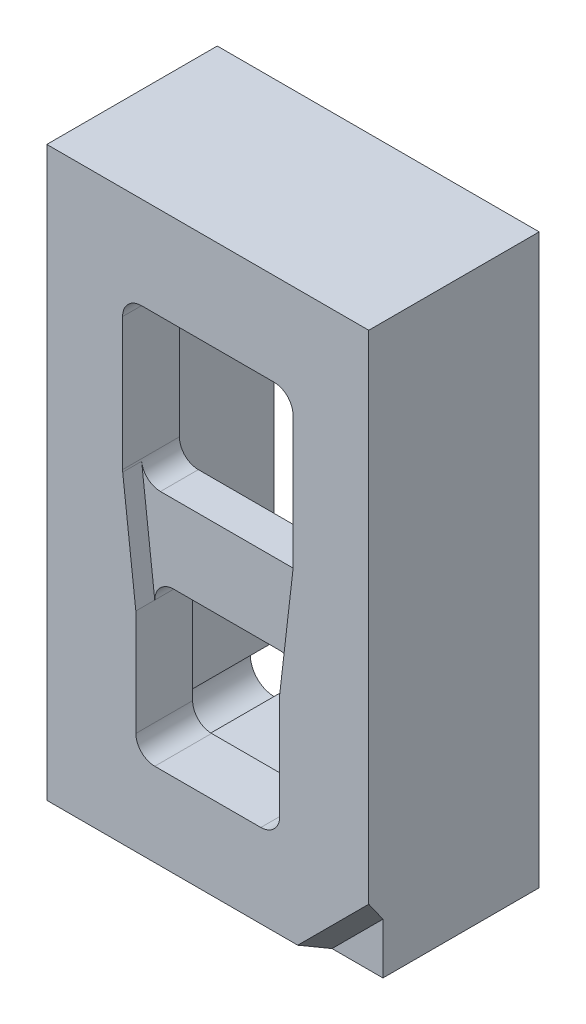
ISO-10303-21;
HEADER;
FILE_DESCRIPTION(('STEP AP214'),'2;1');
FILE_NAME('part.step','',(''),(''),'','','');
FILE_SCHEMA(('AUTOMOTIVE_DESIGN { 1 0 10303 214 1 1 1 1 }'));
ENDSEC;
DATA;
#1=APPLICATION_CONTEXT('core data for automotive mechanical design processes');
#2=APPLICATION_PROTOCOL_DEFINITION('international standard','automotive_design',2000,#1);
#3=PRODUCT_CONTEXT('',#1,'mechanical');
#4=PRODUCT('Part','Part','',(#3));
#5=PRODUCT_RELATED_PRODUCT_CATEGORY('part','',(#4));
#6=PRODUCT_DEFINITION_FORMATION('','',#4);
#7=PRODUCT_DEFINITION_CONTEXT('part definition',#1,'design');
#8=PRODUCT_DEFINITION('design','',#6,#7);
#9=PRODUCT_DEFINITION_SHAPE('','',#8);
#10=(LENGTH_UNIT() NAMED_UNIT(*) SI_UNIT(.MILLI.,.METRE.));
#11=(NAMED_UNIT(*) PLANE_ANGLE_UNIT() SI_UNIT($,.RADIAN.));
#12=(NAMED_UNIT(*) SI_UNIT($,.STERADIAN.) SOLID_ANGLE_UNIT());
#13=UNCERTAINTY_MEASURE_WITH_UNIT(LENGTH_MEASURE(1.E-05),#10,'distance_accuracy_value','');
#14=(GEOMETRIC_REPRESENTATION_CONTEXT(3) GLOBAL_UNCERTAINTY_ASSIGNED_CONTEXT((#13)) GLOBAL_UNIT_ASSIGNED_CONTEXT((#10,
#11,#12)) REPRESENTATION_CONTEXT('',''));
#15=CARTESIAN_POINT('',(0.,0.,0.));
#16=DIRECTION('',(0.,0.,1.));
#17=DIRECTION('',(1.,0.,0.));
#18=AXIS2_PLACEMENT_3D('',#15,#16,#17);
#19=CARTESIAN_POINT('',(-0.9,0.225,0.6));
#20=DIRECTION('',(0.,1.,0.));
#21=DIRECTION('',(0.,0.,1.));
#22=AXIS2_PLACEMENT_3D('',#19,#20,#21);
#23=PLANE('',#22);
#24=DIRECTION('',(0.,0.,-1.));
#25=VECTOR('',#24,1.);
#26=CARTESIAN_POINT('',(-0.7,0.225,0.6));
#27=LINE('',#26,#25);
#28=CARTESIAN_POINT('',(-0.7,0.225,0.));
#29=VERTEX_POINT('',#28);
#30=CARTESIAN_POINT('',(-0.7,0.225,0.4));
#31=VERTEX_POINT('',#30);
#32=EDGE_CURVE('E401',#29,#31,#27,.F.);
#33=ORIENTED_EDGE('',*,*,#32,.T.);
#34=DIRECTION('',(1.,0.,0.));
#35=VECTOR('',#34,1.);
#36=CARTESIAN_POINT('',(-0.9,0.225,0.4));
#37=LINE('',#36,#35);
#38=CARTESIAN_POINT('',(0.7,0.225,0.4));
#39=VERTEX_POINT('',#38);
#40=EDGE_CURVE('E601',#31,#39,#37,.T.);
#41=ORIENTED_EDGE('',*,*,#40,.T.);
#42=DIRECTION('',(0.,0.,-1.));
#43=VECTOR('',#42,1.);
#44=CARTESIAN_POINT('',(0.7,0.225,0.));
#45=LINE('',#44,#43);
#46=CARTESIAN_POINT('',(0.7,0.225,0.));
#47=VERTEX_POINT('',#46);
#48=EDGE_CURVE('E419',#39,#47,#45,.T.);
#49=ORIENTED_EDGE('',*,*,#48,.T.);
#50=DIRECTION('',(1.,0.,0.));
#51=VECTOR('',#50,1.);
#52=CARTESIAN_POINT('',(-0.9,0.225,0.));
#53=LINE('',#52,#51);
#54=EDGE_CURVE('E393',#29,#47,#53,.T.);
#55=ORIENTED_EDGE('',*,*,#54,.F.);
#56=EDGE_LOOP('',(#33,#41,#49,#55));
#57=FACE_BOUND('',#56,.T.);
#58=ADVANCED_FACE('F40',(#57),#23,.T.);
#59=CARTESIAN_POINT('',(-0.76,-0.598,0.6));
#60=DIRECTION('',(0.,-1.,0.));
#61=DIRECTION('',(0.,0.,-1.));
#62=AXIS2_PLACEMENT_3D('',#59,#60,#61);
#63=PLANE('',#62);
#64=DIRECTION('',(0.,0.,-1.));
#65=VECTOR('',#64,1.);
#66=CARTESIAN_POINT('',(0.56,-0.598,0.6));
#67=LINE('',#66,#65);
#68=CARTESIAN_POINT('',(0.56,-0.598,0.));
#69=VERTEX_POINT('',#68);
#70=CARTESIAN_POINT('',(0.56,-0.598,0.4));
#71=VERTEX_POINT('',#70);
#72=EDGE_CURVE('E461',#69,#71,#67,.F.);
#73=ORIENTED_EDGE('',*,*,#72,.T.);
#74=DIRECTION('',(-1.,0.,0.));
#75=VECTOR('',#74,1.);
#76=CARTESIAN_POINT('',(-0.76,-0.598,0.4));
#77=LINE('',#76,#75);
#78=CARTESIAN_POINT('',(-0.56,-0.598,0.4));
#79=VERTEX_POINT('',#78);
#80=EDGE_CURVE('E585',#71,#79,#77,.T.);
#81=ORIENTED_EDGE('',*,*,#80,.T.);
#82=DIRECTION('',(0.,0.,-1.));
#83=VECTOR('',#82,1.);
#84=CARTESIAN_POINT('',(-0.56,-0.598,0.));
#85=LINE('',#84,#83);
#86=CARTESIAN_POINT('',(-0.56,-0.598,0.));
#87=VERTEX_POINT('',#86);
#88=EDGE_CURVE('E458',#79,#87,#85,.T.);
#89=ORIENTED_EDGE('',*,*,#88,.T.);
#90=DIRECTION('',(-1.,0.,0.));
#91=VECTOR('',#90,1.);
#92=CARTESIAN_POINT('',(-0.76,-0.598,0.));
#93=LINE('',#92,#91);
#94=EDGE_CURVE('E377',#69,#87,#93,.T.);
#95=ORIENTED_EDGE('',*,*,#94,.F.);
#96=EDGE_LOOP('',(#73,#81,#89,#95));
#97=FACE_BOUND('',#96,.T.);
#98=ADVANCED_FACE('F739',(#97),#63,.T.);
#99=CARTESIAN_POINT('',(0.7,0.425,0.6));
#100=DIRECTION('',(0.,0.,1.));
#101=DIRECTION('',(1.,0.,0.));
#102=AXIS2_PLACEMENT_3D('',#99,#100,#101);
#103=CYLINDRICAL_SURFACE('',#102,0.2);
#104=DIRECTION('',(0.,0.,1.));
#105=VECTOR('',#104,1.);
#106=CARTESIAN_POINT('',(0.898677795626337,0.402040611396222,0.4));
#107=LINE('',#106,#105);
#108=CARTESIAN_POINT('',(0.898677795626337,0.402040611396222,0.4));
#109=VERTEX_POINT('',#108);
#110=CARTESIAN_POINT('',(0.898677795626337,0.402040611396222,0.6));
#111=VERTEX_POINT('',#110);
#112=EDGE_CURVE('E581',#109,#111,#107,.T.);
#113=ORIENTED_EDGE('',*,*,#112,.T.);
#114=CARTESIAN_POINT('',(0.7,0.425,0.6));
#115=DIRECTION('',(0.,0.,1.));
#116=DIRECTION('',(1.,0.,0.));
#117=AXIS2_PLACEMENT_3D('',#114,#115,#116);
#118=CIRCLE('',#117,0.2);
#119=CARTESIAN_POINT('',(0.9,0.425,0.6));
#120=VERTEX_POINT('',#119);
#121=EDGE_CURVE('E475',#120,#111,#118,.F.);
#122=ORIENTED_EDGE('',*,*,#121,.F.);
#123=DIRECTION('',(0.,0.,-1.));
#124=VECTOR('',#123,1.);
#125=CARTESIAN_POINT('',(0.9,0.425,0.6));
#126=LINE('',#125,#124);
#127=CARTESIAN_POINT('',(0.9,0.425,0.));
#128=VERTEX_POINT('',#127);
#129=EDGE_CURVE('E426',#128,#120,#126,.F.);
#130=ORIENTED_EDGE('',*,*,#129,.F.);
#131=CARTESIAN_POINT('',(0.7,0.425,0.));
#132=DIRECTION('',(0.,0.,1.));
#133=DIRECTION('',(1.,0.,0.));
#134=AXIS2_PLACEMENT_3D('',#131,#132,#133);
#135=CIRCLE('',#134,0.2);
#136=EDGE_CURVE('E472',#47,#128,#135,.T.);
#137=ORIENTED_EDGE('',*,*,#136,.F.);
#138=ORIENTED_EDGE('',*,*,#48,.F.);
#139=CARTESIAN_POINT('',(0.7,0.425,0.4));
#140=DIRECTION('',(0.,0.,1.));
#141=DIRECTION('',(1.,0.,0.));
#142=AXIS2_PLACEMENT_3D('',#139,#140,#141);
#143=CIRCLE('',#142,0.2);
#144=EDGE_CURVE('E605',#109,#39,#143,.F.);
#145=ORIENTED_EDGE('',*,*,#144,.F.);
#146=EDGE_LOOP('',(#113,#122,#130,#137,#138,#145));
#147=FACE_BOUND('',#146,.T.);
#148=ADVANCED_FACE('F718',(#147),#103,.F.);
#149=CARTESIAN_POINT('',(0.56,-0.798,0.6));
#150=DIRECTION('',(0.,0.,1.));
#151=DIRECTION('',(1.,0.,0.));
#152=AXIS2_PLACEMENT_3D('',#149,#150,#151);
#153=CYLINDRICAL_SURFACE('',#152,0.2);
#154=CARTESIAN_POINT('',(0.56,-0.798,0.4));
#155=DIRECTION('',(0.,0.,1.));
#156=DIRECTION('',(1.,0.,0.));
#157=AXIS2_PLACEMENT_3D('',#154,#155,#156);
#158=CIRCLE('',#157,0.2);
#159=CARTESIAN_POINT('',(0.76,-0.798,0.4));
#160=VERTEX_POINT('',#159);
#161=EDGE_CURVE('E595',#71,#160,#158,.F.);
#162=ORIENTED_EDGE('',*,*,#161,.F.);
#163=ORIENTED_EDGE('',*,*,#72,.F.);
#164=CARTESIAN_POINT('',(0.56,-0.798,0.));
#165=DIRECTION('',(0.,0.,1.));
#166=DIRECTION('',(1.,0.,0.));
#167=AXIS2_PLACEMENT_3D('',#164,#165,#166);
#168=CIRCLE('',#167,0.2);
#169=CARTESIAN_POINT('',(0.76,-0.798,0.));
#170=VERTEX_POINT('',#169);
#171=EDGE_CURVE('E497',#170,#69,#168,.T.);
#172=ORIENTED_EDGE('',*,*,#171,.F.);
#173=DIRECTION('',(0.,0.,-1.));
#174=VECTOR('',#173,1.);
#175=CARTESIAN_POINT('',(0.76,-0.798,0.));
#176=LINE('',#175,#174);
#177=EDGE_CURVE('E436',#160,#170,#176,.T.);
#178=ORIENTED_EDGE('',*,*,#177,.F.);
#179=EDGE_LOOP('',(#162,#163,#172,#178));
#180=FACE_BOUND('',#179,.T.);
#181=ADVANCED_FACE('F648',(#180),#153,.F.);
#182=CARTESIAN_POINT('',(-0.56,-0.798,0.6));
#183=DIRECTION('',(0.,0.,1.));
#184=DIRECTION('',(1.,0.,0.));
#185=AXIS2_PLACEMENT_3D('',#182,#183,#184);
#186=CYLINDRICAL_SURFACE('',#185,0.2);
#187=CARTESIAN_POINT('',(-0.56,-0.798,0.4));
#188=DIRECTION('',(0.,0.,1.));
#189=DIRECTION('',(1.,0.,0.));
#190=AXIS2_PLACEMENT_3D('',#187,#188,#189);
#191=CIRCLE('',#190,0.2);
#192=CARTESIAN_POINT('',(-0.76,-0.798,0.4));
#193=VERTEX_POINT('',#192);
#194=EDGE_CURVE('E515',#193,#79,#191,.F.);
#195=ORIENTED_EDGE('',*,*,#194,.F.);
#196=DIRECTION('',(0.,0.,-1.));
#197=VECTOR('',#196,1.);
#198=CARTESIAN_POINT('',(-0.76,-0.798,0.6));
#199=LINE('',#198,#197);
#200=CARTESIAN_POINT('',(-0.76,-0.798,0.));
#201=VERTEX_POINT('',#200);
#202=EDGE_CURVE('E450',#201,#193,#199,.F.);
#203=ORIENTED_EDGE('',*,*,#202,.F.);
#204=CARTESIAN_POINT('',(-0.56,-0.798,0.));
#205=DIRECTION('',(0.,0.,1.));
#206=DIRECTION('',(1.,0.,0.));
#207=AXIS2_PLACEMENT_3D('',#204,#205,#206);
#208=CIRCLE('',#207,0.2);
#209=EDGE_CURVE('E506',#87,#201,#208,.T.);
#210=ORIENTED_EDGE('',*,*,#209,.F.);
#211=ORIENTED_EDGE('',*,*,#88,.F.);
#212=EDGE_LOOP('',(#195,#203,#210,#211));
#213=FACE_BOUND('',#212,.T.);
#214=ADVANCED_FACE('F678',(#213),#186,.F.);
#215=CARTESIAN_POINT('',(0.,0.,0.));
#216=DIRECTION('',(0.,0.,1.));
#217=DIRECTION('',(1.,0.,0.));
#218=AXIS2_PLACEMENT_3D('',#215,#216,#217);
#219=PLANE('',#218);
#220=DIRECTION('',(1.,0.,0.));
#221=VECTOR('',#220,1.);
#222=CARTESIAN_POINT('',(-0.76,-2.118,0.));
#223=LINE('',#222,#221);
#224=CARTESIAN_POINT('',(-0.56,-2.118,0.));
#225=VERTEX_POINT('',#224);
#226=CARTESIAN_POINT('',(0.56,-2.118,0.));
#227=VERTEX_POINT('',#226);
#228=EDGE_CURVE('E365',#225,#227,#223,.T.);
#229=ORIENTED_EDGE('',*,*,#228,.T.);
#230=CARTESIAN_POINT('',(0.56,-1.918,0.));
#231=DIRECTION('',(0.,0.,1.));
#232=DIRECTION('',(1.,0.,0.));
#233=AXIS2_PLACEMENT_3D('',#230,#231,#232);
#234=CIRCLE('',#233,0.2);
#235=CARTESIAN_POINT('',(0.76,-1.918,0.));
#236=VERTEX_POINT('',#235);
#237=EDGE_CURVE('E479',#227,#236,#234,.T.);
#238=ORIENTED_EDGE('',*,*,#237,.T.);
#239=DIRECTION('',(0.,1.,0.));
#240=VECTOR('',#239,1.);
#241=CARTESIAN_POINT('',(0.76,-0.598,0.));
#242=LINE('',#241,#240);
#243=EDGE_CURVE('E359',#236,#170,#242,.T.);
#244=ORIENTED_EDGE('',*,*,#243,.T.);
#245=ORIENTED_EDGE('',*,*,#171,.T.);
#246=ORIENTED_EDGE('',*,*,#94,.T.);
#247=ORIENTED_EDGE('',*,*,#209,.T.);
#248=DIRECTION('',(0.,-1.,0.));
#249=VECTOR('',#248,1.);
#250=CARTESIAN_POINT('',(-0.76,-0.598,0.));
#251=LINE('',#250,#249);
#252=CARTESIAN_POINT('',(-0.76,-1.918,0.));
#253=VERTEX_POINT('',#252);
#254=EDGE_CURVE('E381',#201,#253,#251,.T.);
#255=ORIENTED_EDGE('',*,*,#254,.T.);
#256=CARTESIAN_POINT('',(-0.56,-1.918,0.));
#257=DIRECTION('',(0.,0.,1.));
#258=DIRECTION('',(1.,0.,0.));
#259=AXIS2_PLACEMENT_3D('',#256,#257,#258);
#260=CIRCLE('',#259,0.2);
#261=EDGE_CURVE('E491',#253,#225,#260,.T.);
#262=ORIENTED_EDGE('',*,*,#261,.T.);
#263=EDGE_LOOP('',(#229,#238,#244,#245,#246,#247,#255,#262));
#264=FACE_BOUND('',#263,.T.);
#265=ORIENTED_EDGE('',*,*,#54,.T.);
#266=ORIENTED_EDGE('',*,*,#136,.T.);
#267=DIRECTION('',(0.,1.,0.));
#268=VECTOR('',#267,1.);
#269=CARTESIAN_POINT('',(0.9,0.225,0.));
#270=LINE('',#269,#268);
#271=CARTESIAN_POINT('',(0.9,1.825,0.));
#272=VERTEX_POINT('',#271);
#273=EDGE_CURVE('E373',#128,#272,#270,.T.);
#274=ORIENTED_EDGE('',*,*,#273,.T.);
#275=CARTESIAN_POINT('',(0.7,1.825,0.));
#276=DIRECTION('',(0.,0.,1.));
#277=DIRECTION('',(1.,0.,0.));
#278=AXIS2_PLACEMENT_3D('',#275,#276,#277);
#279=CIRCLE('',#278,0.2);
#280=CARTESIAN_POINT('',(0.7,2.025,0.));
#281=VERTEX_POINT('',#280);
#282=EDGE_CURVE('E500',#272,#281,#279,.T.);
#283=ORIENTED_EDGE('',*,*,#282,.T.);
#284=DIRECTION('',(-1.,0.,0.));
#285=VECTOR('',#284,1.);
#286=CARTESIAN_POINT('',(-0.9,2.025,0.));
#287=LINE('',#286,#285);
#288=CARTESIAN_POINT('',(-0.7,2.025,0.));
#289=VERTEX_POINT('',#288);
#290=EDGE_CURVE('E405',#281,#289,#287,.T.);
#291=ORIENTED_EDGE('',*,*,#290,.T.);
#292=CARTESIAN_POINT('',(-0.7,1.825,0.));
#293=DIRECTION('',(0.,0.,1.));
#294=DIRECTION('',(1.,0.,0.));
#295=AXIS2_PLACEMENT_3D('',#292,#293,#294);
#296=CIRCLE('',#295,0.2);
#297=CARTESIAN_POINT('',(-0.9,1.825,0.));
#298=VERTEX_POINT('',#297);
#299=EDGE_CURVE('E509',#289,#298,#296,.T.);
#300=ORIENTED_EDGE('',*,*,#299,.T.);
#301=DIRECTION('',(0.,-1.,0.));
#302=VECTOR('',#301,1.);
#303=CARTESIAN_POINT('',(-0.9,0.225,0.));
#304=LINE('',#303,#302);
#305=CARTESIAN_POINT('',(-0.9,0.425,0.));
#306=VERTEX_POINT('',#305);
#307=EDGE_CURVE('E409',#298,#306,#304,.T.);
#308=ORIENTED_EDGE('',*,*,#307,.T.);
#309=CARTESIAN_POINT('',(-0.7,0.425,0.));
#310=DIRECTION('',(0.,0.,1.));
#311=DIRECTION('',(1.,0.,0.));
#312=AXIS2_PLACEMENT_3D('',#309,#310,#311);
#313=CIRCLE('',#312,0.2);
#314=EDGE_CURVE('E485',#306,#29,#313,.T.);
#315=ORIENTED_EDGE('',*,*,#314,.T.);
#316=EDGE_LOOP('',(#265,#266,#274,#283,#291,#300,#308,#315));
#317=FACE_BOUND('',#316,.T.);
#318=DIRECTION('',(-1.,0.,0.));
#319=VECTOR('',#318,1.);
#320=CARTESIAN_POINT('',(1.1,2.4,0.));
#321=LINE('',#320,#319);
#322=CARTESIAN_POINT('',(0.85,2.4,0.));
#323=VERTEX_POINT('',#322);
#324=CARTESIAN_POINT('',(-0.85,2.4,0.));
#325=VERTEX_POINT('',#324);
#326=EDGE_CURVE('E276',#323,#325,#321,.T.);
#327=ORIENTED_EDGE('',*,*,#326,.F.);
#328=CARTESIAN_POINT('',(1.1,2.4,0.));
#329=DIRECTION('',(0.,0.,1.));
#330=DIRECTION('',(1.,0.,0.));
#331=AXIS2_PLACEMENT_3D('',#328,#329,#330);
#332=CIRCLE('',#331,0.25);
#333=CARTESIAN_POINT('',(1.1,2.15,0.));
#334=VERTEX_POINT('',#333);
#335=EDGE_CURVE('E267',#323,#334,#332,.F.);
#336=ORIENTED_EDGE('',*,*,#335,.T.);
#337=DIRECTION('',(0.,1.,0.));
#338=VECTOR('',#337,1.);
#339=CARTESIAN_POINT('',(1.1,-2.4,0.));
#340=LINE('',#339,#338);
#341=CARTESIAN_POINT('',(1.1,-2.15,0.));
#342=VERTEX_POINT('',#341);
#343=EDGE_CURVE('E285',#342,#334,#340,.T.);
#344=ORIENTED_EDGE('',*,*,#343,.F.);
#345=CARTESIAN_POINT('',(1.1,-2.4,0.));
#346=DIRECTION('',(0.,0.,1.));
#347=DIRECTION('',(1.,0.,0.));
#348=AXIS2_PLACEMENT_3D('',#345,#346,#347);
#349=CIRCLE('',#348,0.25);
#350=CARTESIAN_POINT('',(0.85,-2.4,0.));
#351=VERTEX_POINT('',#350);
#352=EDGE_CURVE('E546',#342,#351,#349,.F.);
#353=ORIENTED_EDGE('',*,*,#352,.T.);
#354=DIRECTION('',(1.,0.,0.));
#355=VECTOR('',#354,1.);
#356=CARTESIAN_POINT('',(-1.1,-2.4,0.));
#357=LINE('',#356,#355);
#358=CARTESIAN_POINT('',(-0.85,-2.4,0.));
#359=VERTEX_POINT('',#358);
#360=EDGE_CURVE('E294',#359,#351,#357,.T.);
#361=ORIENTED_EDGE('',*,*,#360,.F.);
#362=CARTESIAN_POINT('',(-1.1,-2.4,0.));
#363=DIRECTION('',(0.,0.,1.));
#364=DIRECTION('',(1.,0.,0.));
#365=AXIS2_PLACEMENT_3D('',#362,#363,#364);
#366=CIRCLE('',#365,0.25);
#367=CARTESIAN_POINT('',(-1.1,-2.15,0.));
#368=VERTEX_POINT('',#367);
#369=EDGE_CURVE('E545',#359,#368,#366,.F.);
#370=ORIENTED_EDGE('',*,*,#369,.T.);
#371=DIRECTION('',(0.,-1.,0.));
#372=VECTOR('',#371,1.);
#373=CARTESIAN_POINT('',(-1.1,2.4,0.));
#374=LINE('',#373,#372);
#375=CARTESIAN_POINT('',(-1.1,2.15,0.));
#376=VERTEX_POINT('',#375);
#377=EDGE_CURVE('E309',#376,#368,#374,.T.);
#378=ORIENTED_EDGE('',*,*,#377,.F.);
#379=CARTESIAN_POINT('',(-1.1,2.4,0.));
#380=DIRECTION('',(0.,0.,1.));
#381=DIRECTION('',(1.,0.,0.));
#382=AXIS2_PLACEMENT_3D('',#379,#380,#381);
#383=CIRCLE('',#382,0.25);
#384=EDGE_CURVE('E266',#376,#325,#383,.F.);
#385=ORIENTED_EDGE('',*,*,#384,.T.);
#386=EDGE_LOOP('',(#327,#336,#344,#353,#361,#370,#378,#385));
#387=FACE_BOUND('',#386,.T.);
#388=ADVANCED_FACE('F651',(#264,#317,#387),#219,.F.);
#389=CARTESIAN_POINT('',(0.,0.,0.6));
#390=DIRECTION('',(0.,0.,1.));
#391=DIRECTION('',(1.,0.,0.));
#392=AXIS2_PLACEMENT_3D('',#389,#390,#391);
#393=PLANE('',#392);
#394=DIRECTION('',(0.114796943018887,0.993388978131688,0.));
#395=VECTOR('',#394,1.);
#396=CARTESIAN_POINT('',(0.76,-0.798,0.6));
#397=LINE('',#396,#395);
#398=CARTESIAN_POINT('',(0.76,-0.798,0.6));
#399=VERTEX_POINT('',#398);
#400=EDGE_CURVE('E572',#399,#111,#397,.T.);
#401=ORIENTED_EDGE('',*,*,#400,.F.);
#402=DIRECTION('',(0.,1.,0.));
#403=VECTOR('',#402,1.);
#404=CARTESIAN_POINT('',(0.76,-0.598,0.6));
#405=LINE('',#404,#403);
#406=CARTESIAN_POINT('',(0.76,-1.918,0.6));
#407=VERTEX_POINT('',#406);
#408=EDGE_CURVE('E360',#407,#399,#405,.T.);
#409=ORIENTED_EDGE('',*,*,#408,.F.);
#410=CARTESIAN_POINT('',(0.56,-1.918,0.6));
#411=DIRECTION('',(0.,0.,1.));
#412=DIRECTION('',(1.,0.,0.));
#413=AXIS2_PLACEMENT_3D('',#410,#411,#412);
#414=CIRCLE('',#413,0.2);
#415=CARTESIAN_POINT('',(0.56,-2.118,0.6));
#416=VERTEX_POINT('',#415);
#417=EDGE_CURVE('E482',#407,#416,#414,.F.);
#418=ORIENTED_EDGE('',*,*,#417,.T.);
#419=DIRECTION('',(1.,0.,0.));
#420=VECTOR('',#419,1.);
#421=CARTESIAN_POINT('',(-0.76,-2.118,0.6));
#422=LINE('',#421,#420);
#423=CARTESIAN_POINT('',(-0.56,-2.118,0.6));
#424=VERTEX_POINT('',#423);
#425=EDGE_CURVE('E369',#424,#416,#422,.T.);
#426=ORIENTED_EDGE('',*,*,#425,.F.);
#427=CARTESIAN_POINT('',(-0.56,-1.918,0.6));
#428=DIRECTION('',(0.,0.,1.));
#429=DIRECTION('',(1.,0.,0.));
#430=AXIS2_PLACEMENT_3D('',#427,#428,#429);
#431=CIRCLE('',#430,0.2);
#432=CARTESIAN_POINT('',(-0.76,-1.918,0.6));
#433=VERTEX_POINT('',#432);
#434=EDGE_CURVE('E494',#424,#433,#431,.F.);
#435=ORIENTED_EDGE('',*,*,#434,.T.);
#436=DIRECTION('',(0.,-1.,0.));
#437=VECTOR('',#436,1.);
#438=CARTESIAN_POINT('',(-0.76,-0.598,0.6));
#439=LINE('',#438,#437);
#440=CARTESIAN_POINT('',(-0.76,-0.798,0.6));
#441=VERTEX_POINT('',#440);
#442=EDGE_CURVE('E364',#441,#433,#439,.T.);
#443=ORIENTED_EDGE('',*,*,#442,.F.);
#444=DIRECTION('',(0.114796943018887,-0.993388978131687,0.));
#445=VECTOR('',#444,1.);
#446=CARTESIAN_POINT('',(-0.898677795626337,0.402040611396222,0.6));
#447=LINE('',#446,#445);
#448=CARTESIAN_POINT('',(-0.898677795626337,0.402040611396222,0.6));
#449=VERTEX_POINT('',#448);
#450=EDGE_CURVE('E567',#449,#441,#447,.T.);
#451=ORIENTED_EDGE('',*,*,#450,.F.);
#452=CARTESIAN_POINT('',(-0.7,0.425,0.6));
#453=DIRECTION('',(0.,0.,1.));
#454=DIRECTION('',(1.,0.,0.));
#455=AXIS2_PLACEMENT_3D('',#452,#453,#454);
#456=CIRCLE('',#455,0.2);
#457=CARTESIAN_POINT('',(-0.9,0.425,0.6));
#458=VERTEX_POINT('',#457);
#459=EDGE_CURVE('E488',#449,#458,#456,.F.);
#460=ORIENTED_EDGE('',*,*,#459,.T.);
#461=DIRECTION('',(0.,-1.,0.));
#462=VECTOR('',#461,1.);
#463=CARTESIAN_POINT('',(-0.9,0.225,0.6));
#464=LINE('',#463,#462);
#465=CARTESIAN_POINT('',(-0.9,1.825,0.6));
#466=VERTEX_POINT('',#465);
#467=EDGE_CURVE('E397',#466,#458,#464,.T.);
#468=ORIENTED_EDGE('',*,*,#467,.F.);
#469=CARTESIAN_POINT('',(-0.7,1.825,0.6));
#470=DIRECTION('',(0.,0.,1.));
#471=DIRECTION('',(1.,0.,0.));
#472=AXIS2_PLACEMENT_3D('',#469,#470,#471);
#473=CIRCLE('',#472,0.2);
#474=CARTESIAN_POINT('',(-0.7,2.025,0.6));
#475=VERTEX_POINT('',#474);
#476=EDGE_CURVE('E512',#466,#475,#473,.F.);
#477=ORIENTED_EDGE('',*,*,#476,.T.);
#478=DIRECTION('',(-1.,0.,0.));
#479=VECTOR('',#478,1.);
#480=CARTESIAN_POINT('',(-0.9,2.025,0.6));
#481=LINE('',#480,#479);
#482=CARTESIAN_POINT('',(0.7,2.025,0.6));
#483=VERTEX_POINT('',#482);
#484=EDGE_CURVE('E392',#483,#475,#481,.T.);
#485=ORIENTED_EDGE('',*,*,#484,.F.);
#486=CARTESIAN_POINT('',(0.7,1.825,0.6));
#487=DIRECTION('',(0.,0.,1.));
#488=DIRECTION('',(1.,0.,0.));
#489=AXIS2_PLACEMENT_3D('',#486,#487,#488);
#490=CIRCLE('',#489,0.2);
#491=CARTESIAN_POINT('',(0.9,1.825,0.6));
#492=VERTEX_POINT('',#491);
#493=EDGE_CURVE('E503',#483,#492,#490,.F.);
#494=ORIENTED_EDGE('',*,*,#493,.T.);
#495=DIRECTION('',(0.,1.,0.));
#496=VECTOR('',#495,1.);
#497=CARTESIAN_POINT('',(0.9,0.225,0.6));
#498=LINE('',#497,#496);
#499=EDGE_CURVE('E388',#120,#492,#498,.T.);
#500=ORIENTED_EDGE('',*,*,#499,.F.);
#501=ORIENTED_EDGE('',*,*,#121,.T.);
#502=EDGE_LOOP('',(#401,#409,#418,#426,#435,#443,#451,#460,#468,#477,#485,#494,#500,#501));
#503=FACE_BOUND('',#502,.T.);
#504=DIRECTION('',(-0.707106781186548,-0.707106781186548,0.));
#505=VECTOR('',#504,1.);
#506=CARTESIAN_POINT('',(0.95,-3.,0.6));
#507=LINE('',#506,#505);
#508=CARTESIAN_POINT('',(1.7,-2.25,0.6));
#509=VERTEX_POINT('',#508);
#510=CARTESIAN_POINT('',(0.95,-3.,0.6));
#511=VERTEX_POINT('',#510);
#512=EDGE_CURVE('E297',#509,#511,#507,.T.);
#513=ORIENTED_EDGE('',*,*,#512,.F.);
#514=DIRECTION('',(0.,1.,0.));
#515=VECTOR('',#514,1.);
#516=CARTESIAN_POINT('',(1.7,-3.,0.6));
#517=LINE('',#516,#515);
#518=CARTESIAN_POINT('',(1.7,3.,0.600000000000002));
#519=VERTEX_POINT('',#518);
#520=EDGE_CURVE('E340',#509,#519,#517,.T.);
#521=ORIENTED_EDGE('',*,*,#520,.T.);
#522=DIRECTION('',(-1.,0.,0.));
#523=VECTOR('',#522,1.);
#524=CARTESIAN_POINT('',(1.7,3.,0.6));
#525=LINE('',#524,#523);
#526=CARTESIAN_POINT('',(-1.7,3.,0.600000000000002));
#527=VERTEX_POINT('',#526);
#528=EDGE_CURVE('E336',#519,#527,#525,.T.);
#529=ORIENTED_EDGE('',*,*,#528,.T.);
#530=DIRECTION('',(0.,-1.,0.));
#531=VECTOR('',#530,1.);
#532=CARTESIAN_POINT('',(-1.7,3.,0.6));
#533=LINE('',#532,#531);
#534=CARTESIAN_POINT('',(-1.7,-3.,0.6));
#535=VERTEX_POINT('',#534);
#536=EDGE_CURVE('E332',#527,#535,#533,.T.);
#537=ORIENTED_EDGE('',*,*,#536,.T.);
#538=DIRECTION('',(1.,0.,0.));
#539=VECTOR('',#538,1.);
#540=CARTESIAN_POINT('',(-1.7,-3.,0.6));
#541=LINE('',#540,#539);
#542=EDGE_CURVE('E343',#535,#511,#541,.T.);
#543=ORIENTED_EDGE('',*,*,#542,.T.);
#544=EDGE_LOOP('',(#513,#521,#529,#537,#543));
#545=FACE_BOUND('',#544,.T.);
#546=ADVANCED_FACE('F635',(#503,#545),#393,.T.);
#547=CARTESIAN_POINT('',(0.9,0.225,0.6));
#548=DIRECTION('',(-1.,0.,0.));
#549=DIRECTION('',(0.,0.,1.));
#550=AXIS2_PLACEMENT_3D('',#547,#548,#549);
#551=PLANE('',#550);
#552=ORIENTED_EDGE('',*,*,#273,.F.);
#553=ORIENTED_EDGE('',*,*,#129,.T.);
#554=ORIENTED_EDGE('',*,*,#499,.T.);
#555=DIRECTION('',(0.,0.,-1.));
#556=VECTOR('',#555,1.);
#557=CARTESIAN_POINT('',(0.9,1.825,0.));
#558=LINE('',#557,#556);
#559=EDGE_CURVE('E422',#492,#272,#558,.T.);
#560=ORIENTED_EDGE('',*,*,#559,.T.);
#561=EDGE_LOOP('',(#552,#553,#554,#560));
#562=FACE_BOUND('',#561,.T.);
#563=ADVANCED_FACE('F713',(#562),#551,.T.);
#564=CARTESIAN_POINT('',(-0.9,2.025,0.6));
#565=DIRECTION('',(0.,-1.,0.));
#566=DIRECTION('',(0.,0.,-1.));
#567=AXIS2_PLACEMENT_3D('',#564,#565,#566);
#568=PLANE('',#567);
#569=ORIENTED_EDGE('',*,*,#290,.F.);
#570=DIRECTION('',(0.,0.,-1.));
#571=VECTOR('',#570,1.);
#572=CARTESIAN_POINT('',(0.7,2.025,0.6));
#573=LINE('',#572,#571);
#574=EDGE_CURVE('E469',#281,#483,#573,.F.);
#575=ORIENTED_EDGE('',*,*,#574,.T.);
#576=ORIENTED_EDGE('',*,*,#484,.T.);
#577=DIRECTION('',(0.,0.,-1.));
#578=VECTOR('',#577,1.);
#579=CARTESIAN_POINT('',(-0.7,2.025,0.));
#580=LINE('',#579,#578);
#581=EDGE_CURVE('E465',#475,#289,#580,.T.);
#582=ORIENTED_EDGE('',*,*,#581,.T.);
#583=EDGE_LOOP('',(#569,#575,#576,#582));
#584=FACE_BOUND('',#583,.T.);
#585=ADVANCED_FACE('F703',(#584),#568,.T.);
#586=CARTESIAN_POINT('',(-0.9,0.225,0.6));
#587=DIRECTION('',(1.,0.,0.));
#588=DIRECTION('',(0.,0.,-1.));
#589=AXIS2_PLACEMENT_3D('',#586,#587,#588);
#590=PLANE('',#589);
#591=ORIENTED_EDGE('',*,*,#467,.T.);
#592=DIRECTION('',(0.,0.,-1.));
#593=VECTOR('',#592,1.);
#594=CARTESIAN_POINT('',(-0.9,0.425,0.));
#595=LINE('',#594,#593);
#596=EDGE_CURVE('E446',#458,#306,#595,.T.);
#597=ORIENTED_EDGE('',*,*,#596,.T.);
#598=ORIENTED_EDGE('',*,*,#307,.F.);
#599=DIRECTION('',(0.,0.,-1.));
#600=VECTOR('',#599,1.);
#601=CARTESIAN_POINT('',(-0.9,1.825,0.6));
#602=LINE('',#601,#600);
#603=EDGE_CURVE('E443',#298,#466,#602,.F.);
#604=ORIENTED_EDGE('',*,*,#603,.T.);
#605=EDGE_LOOP('',(#591,#597,#598,#604));
#606=FACE_BOUND('',#605,.T.);
#607=ADVANCED_FACE('F693',(#606),#590,.T.);
#608=CARTESIAN_POINT('',(0.76,-0.598,0.6));
#609=DIRECTION('',(-1.,0.,0.));
#610=DIRECTION('',(0.,-1.,0.));
#611=AXIS2_PLACEMENT_3D('',#608,#609,#610);
#612=PLANE('',#611);
#613=ORIENTED_EDGE('',*,*,#243,.F.);
#614=DIRECTION('',(0.,0.,-1.));
#615=VECTOR('',#614,1.);
#616=CARTESIAN_POINT('',(0.76,-1.918,0.6));
#617=LINE('',#616,#615);
#618=EDGE_CURVE('E440',#236,#407,#617,.F.);
#619=ORIENTED_EDGE('',*,*,#618,.T.);
#620=ORIENTED_EDGE('',*,*,#408,.T.);
#621=EDGE_CURVE('E437',#399,#160,#176,.T.);
#622=ORIENTED_EDGE('',*,*,#621,.T.);
#623=ORIENTED_EDGE('',*,*,#177,.T.);
#624=EDGE_LOOP('',(#613,#619,#620,#622,#623));
#625=FACE_BOUND('',#624,.T.);
#626=ADVANCED_FACE('F643',(#625),#612,.T.);
#627=CARTESIAN_POINT('',(-0.76,-0.598,0.6));
#628=DIRECTION('',(1.,0.,0.));
#629=DIRECTION('',(0.,1.,0.));
#630=AXIS2_PLACEMENT_3D('',#627,#628,#629);
#631=PLANE('',#630);
#632=ORIENTED_EDGE('',*,*,#442,.T.);
#633=DIRECTION('',(0.,0.,-1.));
#634=VECTOR('',#633,1.);
#635=CARTESIAN_POINT('',(-0.76,-1.918,0.));
#636=LINE('',#635,#634);
#637=EDGE_CURVE('E454',#433,#253,#636,.T.);
#638=ORIENTED_EDGE('',*,*,#637,.T.);
#639=ORIENTED_EDGE('',*,*,#254,.F.);
#640=ORIENTED_EDGE('',*,*,#202,.T.);
#641=DIRECTION('',(0.,0.,1.));
#642=VECTOR('',#641,1.);
#643=CARTESIAN_POINT('',(-0.76,-0.798,0.4));
#644=LINE('',#643,#642);
#645=EDGE_CURVE('E586',#193,#441,#644,.T.);
#646=ORIENTED_EDGE('',*,*,#645,.T.);
#647=EDGE_LOOP('',(#632,#638,#639,#640,#646));
#648=FACE_BOUND('',#647,.T.);
#649=ADVANCED_FACE('F672',(#648),#631,.T.);
#650=CARTESIAN_POINT('',(-0.76,-2.118,0.6));
#651=DIRECTION('',(0.,1.,0.));
#652=DIRECTION('',(0.,0.,1.));
#653=AXIS2_PLACEMENT_3D('',#650,#651,#652);
#654=PLANE('',#653);
#655=ORIENTED_EDGE('',*,*,#425,.T.);
#656=DIRECTION('',(0.,0.,-1.));
#657=VECTOR('',#656,1.);
#658=CARTESIAN_POINT('',(0.56,-2.118,0.));
#659=LINE('',#658,#657);
#660=EDGE_CURVE('E432',#416,#227,#659,.T.);
#661=ORIENTED_EDGE('',*,*,#660,.T.);
#662=ORIENTED_EDGE('',*,*,#228,.F.);
#663=DIRECTION('',(0.,0.,-1.));
#664=VECTOR('',#663,1.);
#665=CARTESIAN_POINT('',(-0.56,-2.118,0.6));
#666=LINE('',#665,#664);
#667=EDGE_CURVE('E429',#225,#424,#666,.F.);
#668=ORIENTED_EDGE('',*,*,#667,.T.);
#669=EDGE_LOOP('',(#655,#661,#662,#668));
#670=FACE_BOUND('',#669,.T.);
#671=ADVANCED_FACE('F659',(#670),#654,.T.);
#672=CARTESIAN_POINT('',(-1.7,3.,7.49637585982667));
#673=DIRECTION('',(1.,0.,0.));
#674=DIRECTION('',(0.,1.,0.));
#675=AXIS2_PLACEMENT_3D('',#672,#673,#674);
#676=PLANE('',#675);
#677=ORIENTED_EDGE('',*,*,#536,.F.);
#678=DIRECTION('',(0.,0.,-1.));
#679=VECTOR('',#678,1.);
#680=CARTESIAN_POINT('',(-1.7,3.,7.49637585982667));
#681=LINE('',#680,#679);
#682=CARTESIAN_POINT('',(-1.7,3.,-1.2));
#683=VERTEX_POINT('',#682);
#684=EDGE_CURVE('E350',#527,#683,#681,.T.);
#685=ORIENTED_EDGE('',*,*,#684,.T.);
#686=DIRECTION('',(0.,-1.,0.));
#687=VECTOR('',#686,1.);
#688=CARTESIAN_POINT('',(-1.7,3.,-1.2));
#689=LINE('',#688,#687);
#690=CARTESIAN_POINT('',(-1.7,-3.,-1.2));
#691=VERTEX_POINT('',#690);
#692=EDGE_CURVE('E324',#683,#691,#689,.T.);
#693=ORIENTED_EDGE('',*,*,#692,.T.);
#694=DIRECTION('',(0.,0.,-1.));
#695=VECTOR('',#694,1.);
#696=CARTESIAN_POINT('',(-1.7,-3.,7.49637585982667));
#697=LINE('',#696,#695);
#698=EDGE_CURVE('E347',#535,#691,#697,.T.);
#699=ORIENTED_EDGE('',*,*,#698,.F.);
#700=EDGE_LOOP('',(#677,#685,#693,#699));
#701=FACE_BOUND('',#700,.T.);
#702=ADVANCED_FACE('F1005',(#701),#676,.F.);
#703=CARTESIAN_POINT('',(1.7,3.,7.49637585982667));
#704=DIRECTION('',(0.,-1.,0.));
#705=DIRECTION('',(1.,0.,0.));
#706=AXIS2_PLACEMENT_3D('',#703,#704,#705);
#707=PLANE('',#706);
#708=ORIENTED_EDGE('',*,*,#528,.F.);
#709=DIRECTION('',(0.,0.,-1.));
#710=VECTOR('',#709,1.);
#711=CARTESIAN_POINT('',(1.7,3.,7.49637585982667));
#712=LINE('',#711,#710);
#713=CARTESIAN_POINT('',(1.7,3.,-1.2));
#714=VERTEX_POINT('',#713);
#715=EDGE_CURVE('E353',#519,#714,#712,.T.);
#716=ORIENTED_EDGE('',*,*,#715,.T.);
#717=DIRECTION('',(-1.,0.,0.));
#718=VECTOR('',#717,1.);
#719=CARTESIAN_POINT('',(1.7,3.,-1.2));
#720=LINE('',#719,#718);
#721=EDGE_CURVE('E320',#714,#683,#720,.T.);
#722=ORIENTED_EDGE('',*,*,#721,.T.);
#723=ORIENTED_EDGE('',*,*,#684,.F.);
#724=EDGE_LOOP('',(#708,#716,#722,#723));
#725=FACE_BOUND('',#724,.T.);
#726=ADVANCED_FACE('F631',(#725),#707,.F.);
#727=CARTESIAN_POINT('',(1.7,-3.,7.49637585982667));
#728=DIRECTION('',(-1.,0.,0.));
#729=DIRECTION('',(0.,0.,1.));
#730=AXIS2_PLACEMENT_3D('',#727,#728,#729);
#731=PLANE('',#730);
#732=ORIENTED_EDGE('',*,*,#520,.F.);
#733=DIRECTION('',(0.,-0.816496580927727,-0.577350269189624));
#734=VECTOR('',#733,1.);
#735=CARTESIAN_POINT('',(1.7,-2.75,0.246446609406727));
#736=LINE('',#735,#734);
#737=CARTESIAN_POINT('',(1.7,-2.46213203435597,0.45));
#738=VERTEX_POINT('',#737);
#739=EDGE_CURVE('E516',#738,#509,#736,.F.);
#740=ORIENTED_EDGE('',*,*,#739,.F.);
#741=DIRECTION('',(0.,1.,0.));
#742=VECTOR('',#741,1.);
#743=CARTESIAN_POINT('',(1.7,-2.25,0.45));
#744=LINE('',#743,#742);
#745=CARTESIAN_POINT('',(1.7,-3.,0.45));
#746=VERTEX_POINT('',#745);
#747=EDGE_CURVE('E523',#746,#738,#744,.T.);
#748=ORIENTED_EDGE('',*,*,#747,.F.);
#749=DIRECTION('',(0.,0.,-1.));
#750=VECTOR('',#749,1.);
#751=CARTESIAN_POINT('',(1.7,-3.,7.49637585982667));
#752=LINE('',#751,#750);
#753=CARTESIAN_POINT('',(1.7,-3.,-1.2));
#754=VERTEX_POINT('',#753);
#755=EDGE_CURVE('E356',#746,#754,#752,.T.);
#756=ORIENTED_EDGE('',*,*,#755,.T.);
#757=DIRECTION('',(0.,1.,0.));
#758=VECTOR('',#757,1.);
#759=CARTESIAN_POINT('',(1.7,-3.,-1.2));
#760=LINE('',#759,#758);
#761=EDGE_CURVE('E306',#754,#714,#760,.T.);
#762=ORIENTED_EDGE('',*,*,#761,.T.);
#763=ORIENTED_EDGE('',*,*,#715,.F.);
#764=EDGE_LOOP('',(#732,#740,#748,#756,#762,#763));
#765=FACE_BOUND('',#764,.T.);
#766=ADVANCED_FACE('F621',(#765),#731,.F.);
#767=CARTESIAN_POINT('',(-1.7,-3.,7.49637585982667));
#768=DIRECTION('',(0.,1.,0.));
#769=DIRECTION('',(0.,0.,1.));
#770=AXIS2_PLACEMENT_3D('',#767,#768,#769);
#771=PLANE('',#770);
#772=DIRECTION('',(1.,0.,0.));
#773=VECTOR('',#772,1.);
#774=CARTESIAN_POINT('',(1.7,-3.,0.45));
#775=LINE('',#774,#773);
#776=CARTESIAN_POINT('',(1.16213203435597,-3.,0.45));
#777=VERTEX_POINT('',#776);
#778=EDGE_CURVE('E519',#777,#746,#775,.T.);
#779=ORIENTED_EDGE('',*,*,#778,.F.);
#780=DIRECTION('',(0.816496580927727,0.,-0.577350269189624));
#781=VECTOR('',#780,1.);
#782=CARTESIAN_POINT('',(-4.0676494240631,-3.,4.14801393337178));
#783=LINE('',#782,#781);
#784=EDGE_CURVE('E310',#777,#511,#783,.F.);
#785=ORIENTED_EDGE('',*,*,#784,.T.);
#786=ORIENTED_EDGE('',*,*,#542,.F.);
#787=ORIENTED_EDGE('',*,*,#698,.T.);
#788=DIRECTION('',(1.,0.,0.));
#789=VECTOR('',#788,1.);
#790=CARTESIAN_POINT('',(-1.7,-3.,-1.2));
#791=LINE('',#790,#789);
#792=EDGE_CURVE('E328',#691,#754,#791,.T.);
#793=ORIENTED_EDGE('',*,*,#792,.T.);
#794=ORIENTED_EDGE('',*,*,#755,.F.);
#795=EDGE_LOOP('',(#779,#785,#786,#787,#793,#794));
#796=FACE_BOUND('',#795,.T.);
#797=ADVANCED_FACE('F623',(#796),#771,.F.);
#798=CARTESIAN_POINT('',(0.,0.,-1.2));
#799=DIRECTION('',(0.,0.,1.));
#800=DIRECTION('',(1.,0.,0.));
#801=AXIS2_PLACEMENT_3D('',#798,#799,#800);
#802=PLANE('',#801);
#803=DIRECTION('',(0.,1.,0.));
#804=VECTOR('',#803,1.);
#805=CARTESIAN_POINT('',(1.1,-2.4,-1.2));
#806=LINE('',#805,#804);
#807=CARTESIAN_POINT('',(1.1,-2.15,-1.2));
#808=VERTEX_POINT('',#807);
#809=CARTESIAN_POINT('',(1.1,2.15,-1.2));
#810=VERTEX_POINT('',#809);
#811=EDGE_CURVE('E303',#808,#810,#806,.T.);
#812=ORIENTED_EDGE('',*,*,#811,.T.);
#813=CARTESIAN_POINT('',(1.1,2.4,-1.2));
#814=DIRECTION('',(0.,0.,-1.));
#815=DIRECTION('',(-1.,0.,0.));
#816=AXIS2_PLACEMENT_3D('',#813,#814,#815);
#817=CIRCLE('',#816,0.25);
#818=CARTESIAN_POINT('',(0.85,2.4,-1.2));
#819=VERTEX_POINT('',#818);
#820=EDGE_CURVE('E56',#819,#810,#817,.T.);
#821=ORIENTED_EDGE('',*,*,#820,.F.);
#822=DIRECTION('',(-1.,0.,0.));
#823=VECTOR('',#822,1.);
#824=CARTESIAN_POINT('',(1.1,2.4,-1.2));
#825=LINE('',#824,#823);
#826=CARTESIAN_POINT('',(-0.85,2.4,-1.2));
#827=VERTEX_POINT('',#826);
#828=EDGE_CURVE('E274',#819,#827,#825,.T.);
#829=ORIENTED_EDGE('',*,*,#828,.T.);
#830=CARTESIAN_POINT('',(-1.1,2.4,-1.2));
#831=DIRECTION('',(0.,0.,-1.));
#832=DIRECTION('',(-1.,0.,0.));
#833=AXIS2_PLACEMENT_3D('',#830,#831,#832);
#834=CIRCLE('',#833,0.25);
#835=CARTESIAN_POINT('',(-1.1,2.15,-1.2));
#836=VERTEX_POINT('',#835);
#837=EDGE_CURVE('E254',#836,#827,#834,.T.);
#838=ORIENTED_EDGE('',*,*,#837,.F.);
#839=DIRECTION('',(0.,-1.,0.));
#840=VECTOR('',#839,1.);
#841=CARTESIAN_POINT('',(-1.1,2.4,-1.2));
#842=LINE('',#841,#840);
#843=CARTESIAN_POINT('',(-1.1,-2.15,-1.2));
#844=VERTEX_POINT('',#843);
#845=EDGE_CURVE('E284',#836,#844,#842,.T.);
#846=ORIENTED_EDGE('',*,*,#845,.T.);
#847=CARTESIAN_POINT('',(-1.1,-2.4,-1.2));
#848=DIRECTION('',(0.,0.,-1.));
#849=DIRECTION('',(-1.,0.,0.));
#850=AXIS2_PLACEMENT_3D('',#847,#848,#849);
#851=CIRCLE('',#850,0.25);
#852=CARTESIAN_POINT('',(-0.85,-2.4,-1.2));
#853=VERTEX_POINT('',#852);
#854=EDGE_CURVE('E542',#853,#844,#851,.T.);
#855=ORIENTED_EDGE('',*,*,#854,.F.);
#856=DIRECTION('',(1.,0.,0.));
#857=VECTOR('',#856,1.);
#858=CARTESIAN_POINT('',(-1.1,-2.4,-1.2));
#859=LINE('',#858,#857);
#860=CARTESIAN_POINT('',(0.85,-2.4,-1.2));
#861=VERTEX_POINT('',#860);
#862=EDGE_CURVE('E290',#853,#861,#859,.T.);
#863=ORIENTED_EDGE('',*,*,#862,.T.);
#864=CARTESIAN_POINT('',(1.1,-2.4,-1.2));
#865=DIRECTION('',(0.,0.,-1.));
#866=DIRECTION('',(-1.,0.,0.));
#867=AXIS2_PLACEMENT_3D('',#864,#865,#866);
#868=CIRCLE('',#867,0.25);
#869=EDGE_CURVE('E63',#808,#861,#868,.T.);
#870=ORIENTED_EDGE('',*,*,#869,.F.);
#871=EDGE_LOOP('',(#812,#821,#829,#838,#846,#855,#863,#870));
#872=FACE_BOUND('',#871,.T.);
#873=ORIENTED_EDGE('',*,*,#761,.F.);
#874=ORIENTED_EDGE('',*,*,#792,.F.);
#875=ORIENTED_EDGE('',*,*,#692,.F.);
#876=ORIENTED_EDGE('',*,*,#721,.F.);
#877=EDGE_LOOP('',(#873,#874,#875,#876));
#878=FACE_BOUND('',#877,.T.);
#879=ADVANCED_FACE('F281',(#872,#878),#802,.F.);
#880=CARTESIAN_POINT('',(1.1,2.4,-1.2));
#881=DIRECTION('',(0.,1.,0.));
#882=DIRECTION('',(-1.,0.,0.));
#883=AXIS2_PLACEMENT_3D('',#880,#881,#882);
#884=PLANE('',#883);
#885=ORIENTED_EDGE('',*,*,#828,.F.);
#886=DIRECTION('',(0.,0.,-1.));
#887=VECTOR('',#886,1.);
#888=CARTESIAN_POINT('',(0.85,2.4,0.707106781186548));
#889=LINE('',#888,#887);
#890=EDGE_CURVE('E564',#819,#323,#889,.F.);
#891=ORIENTED_EDGE('',*,*,#890,.T.);
#892=ORIENTED_EDGE('',*,*,#326,.T.);
#893=DIRECTION('',(0.,0.,-1.));
#894=VECTOR('',#893,1.);
#895=CARTESIAN_POINT('',(-0.85,2.4,0.707106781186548));
#896=LINE('',#895,#894);
#897=EDGE_CURVE('E257',#325,#827,#896,.T.);
#898=ORIENTED_EDGE('',*,*,#897,.T.);
#899=EDGE_LOOP('',(#885,#891,#892,#898));
#900=FACE_BOUND('',#899,.T.);
#901=ADVANCED_FACE('F272',(#900),#884,.F.);
#902=CARTESIAN_POINT('',(1.1,-2.4,-1.2));
#903=DIRECTION('',(1.,0.,0.));
#904=DIRECTION('',(0.,0.,-1.));
#905=AXIS2_PLACEMENT_3D('',#902,#903,#904);
#906=PLANE('',#905);
#907=ORIENTED_EDGE('',*,*,#343,.T.);
#908=DIRECTION('',(0.,0.,-1.));
#909=VECTOR('',#908,1.);
#910=CARTESIAN_POINT('',(1.1,2.15,0.707106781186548));
#911=LINE('',#910,#909);
#912=EDGE_CURVE('E11',#334,#810,#911,.T.);
#913=ORIENTED_EDGE('',*,*,#912,.T.);
#914=ORIENTED_EDGE('',*,*,#811,.F.);
#915=DIRECTION('',(0.,0.,-1.));
#916=VECTOR('',#915,1.);
#917=CARTESIAN_POINT('',(1.1,-2.15,0.707106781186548));
#918=LINE('',#917,#916);
#919=EDGE_CURVE('E560',#808,#342,#918,.F.);
#920=ORIENTED_EDGE('',*,*,#919,.T.);
#921=EDGE_LOOP('',(#907,#913,#914,#920));
#922=FACE_BOUND('',#921,.T.);
#923=ADVANCED_FACE('F832',(#922),#906,.F.);
#924=CARTESIAN_POINT('',(-1.1,-2.4,-1.2));
#925=DIRECTION('',(0.,-1.,0.));
#926=DIRECTION('',(0.,0.,-1.));
#927=AXIS2_PLACEMENT_3D('',#924,#925,#926);
#928=PLANE('',#927);
#929=ORIENTED_EDGE('',*,*,#862,.F.);
#930=DIRECTION('',(0.,0.,-1.));
#931=VECTOR('',#930,1.);
#932=CARTESIAN_POINT('',(-0.85,-2.4,0.707106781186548));
#933=LINE('',#932,#931);
#934=EDGE_CURVE('E278',#853,#359,#933,.F.);
#935=ORIENTED_EDGE('',*,*,#934,.T.);
#936=ORIENTED_EDGE('',*,*,#360,.T.);
#937=DIRECTION('',(0.,0.,-1.));
#938=VECTOR('',#937,1.);
#939=CARTESIAN_POINT('',(0.85,-2.4,0.707106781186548));
#940=LINE('',#939,#938);
#941=EDGE_CURVE('E49',#351,#861,#940,.T.);
#942=ORIENTED_EDGE('',*,*,#941,.T.);
#943=EDGE_LOOP('',(#929,#935,#936,#942));
#944=FACE_BOUND('',#943,.T.);
#945=ADVANCED_FACE('F536',(#944),#928,.F.);
#946=CARTESIAN_POINT('',(-1.1,2.4,-1.2));
#947=DIRECTION('',(-1.,0.,0.));
#948=DIRECTION('',(0.,0.,1.));
#949=AXIS2_PLACEMENT_3D('',#946,#947,#948);
#950=PLANE('',#949);
#951=ORIENTED_EDGE('',*,*,#377,.T.);
#952=DIRECTION('',(0.,0.,-1.));
#953=VECTOR('',#952,1.);
#954=CARTESIAN_POINT('',(-1.1,-2.15,0.707106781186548));
#955=LINE('',#954,#953);
#956=EDGE_CURVE('E531',#368,#844,#955,.T.);
#957=ORIENTED_EDGE('',*,*,#956,.T.);
#958=ORIENTED_EDGE('',*,*,#845,.F.);
#959=DIRECTION('',(0.,0.,-1.));
#960=VECTOR('',#959,1.);
#961=CARTESIAN_POINT('',(-1.1,2.15,0.707106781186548));
#962=LINE('',#961,#960);
#963=EDGE_CURVE('E260',#836,#376,#962,.F.);
#964=ORIENTED_EDGE('',*,*,#963,.T.);
#965=EDGE_LOOP('',(#951,#957,#958,#964));
#966=FACE_BOUND('',#965,.T.);
#967=ADVANCED_FACE('F815',(#966),#950,.F.);
#968=CARTESIAN_POINT('',(0.95,-3.,0.6));
#969=DIRECTION('',(0.499999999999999,-0.499999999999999,0.707106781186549));
#970=DIRECTION('',(0.816496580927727,0.,-0.577350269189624));
#971=AXIS2_PLACEMENT_3D('',#968,#969,#970);
#972=PLANE('',#971);
#973=ORIENTED_EDGE('',*,*,#512,.T.);
#974=ORIENTED_EDGE('',*,*,#784,.F.);
#975=DIRECTION('',(0.707106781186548,0.707106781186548,0.));
#976=VECTOR('',#975,1.);
#977=CARTESIAN_POINT('',(1.05606601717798,-3.10606601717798,0.45));
#978=LINE('',#977,#976);
#979=EDGE_CURVE('E520',#738,#777,#978,.F.);
#980=ORIENTED_EDGE('',*,*,#979,.F.);
#981=ORIENTED_EDGE('',*,*,#739,.T.);
#982=EDGE_LOOP('',(#973,#974,#980,#981));
#983=FACE_BOUND('',#982,.T.);
#984=ADVANCED_FACE('F42',(#983),#972,.T.);
#985=CARTESIAN_POINT('',(0.,0.,0.45));
#986=DIRECTION('',(0.,0.,-1.));
#987=DIRECTION('',(-1.,0.,0.));
#988=AXIS2_PLACEMENT_3D('',#985,#986,#987);
#989=PLANE('',#988);
#990=ORIENTED_EDGE('',*,*,#747,.T.);
#991=ORIENTED_EDGE('',*,*,#979,.T.);
#992=ORIENTED_EDGE('',*,*,#778,.T.);
#993=EDGE_LOOP('',(#990,#991,#992));
#994=FACE_BOUND('',#993,.T.);
#995=ADVANCED_FACE('F614',(#994),#989,.F.);
#996=CARTESIAN_POINT('',(0.56,-1.918,0.6));
#997=DIRECTION('',(0.,0.,1.));
#998=DIRECTION('',(1.,0.,0.));
#999=AXIS2_PLACEMENT_3D('',#996,#997,#998);
#1000=CYLINDRICAL_SURFACE('',#999,0.2);
#1001=ORIENTED_EDGE('',*,*,#417,.F.);
#1002=ORIENTED_EDGE('',*,*,#618,.F.);
#1003=ORIENTED_EDGE('',*,*,#237,.F.);
#1004=ORIENTED_EDGE('',*,*,#660,.F.);
#1005=EDGE_LOOP('',(#1001,#1002,#1003,#1004));
#1006=FACE_BOUND('',#1005,.T.);
#1007=ADVANCED_FACE('F657',(#1006),#1000,.F.);
#1008=CARTESIAN_POINT('',(-0.7,0.425,0.6));
#1009=DIRECTION('',(0.,0.,1.));
#1010=DIRECTION('',(1.,0.,0.));
#1011=AXIS2_PLACEMENT_3D('',#1008,#1009,#1010);
#1012=CYLINDRICAL_SURFACE('',#1011,0.2);
#1013=ORIENTED_EDGE('',*,*,#459,.F.);
#1014=DIRECTION('',(0.,0.,1.));
#1015=VECTOR('',#1014,1.);
#1016=CARTESIAN_POINT('',(-0.898677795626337,0.402040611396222,0.4));
#1017=LINE('',#1016,#1015);
#1018=CARTESIAN_POINT('',(-0.898677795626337,0.402040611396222,0.4));
#1019=VERTEX_POINT('',#1018);
#1020=EDGE_CURVE('E576',#1019,#449,#1017,.T.);
#1021=ORIENTED_EDGE('',*,*,#1020,.F.);
#1022=CARTESIAN_POINT('',(-0.7,0.425,0.4));
#1023=DIRECTION('',(0.,0.,1.));
#1024=DIRECTION('',(1.,0.,0.));
#1025=AXIS2_PLACEMENT_3D('',#1022,#1023,#1024);
#1026=CIRCLE('',#1025,0.2);
#1027=EDGE_CURVE('E598',#31,#1019,#1026,.F.);
#1028=ORIENTED_EDGE('',*,*,#1027,.F.);
#1029=ORIENTED_EDGE('',*,*,#32,.F.);
#1030=ORIENTED_EDGE('',*,*,#314,.F.);
#1031=ORIENTED_EDGE('',*,*,#596,.F.);
#1032=EDGE_LOOP('',(#1013,#1021,#1028,#1029,#1030,#1031));
#1033=FACE_BOUND('',#1032,.T.);
#1034=ADVANCED_FACE('F688',(#1033),#1012,.F.);
#1035=CARTESIAN_POINT('',(-0.56,-1.918,0.6));
#1036=DIRECTION('',(0.,0.,1.));
#1037=DIRECTION('',(1.,0.,0.));
#1038=AXIS2_PLACEMENT_3D('',#1035,#1036,#1037);
#1039=CYLINDRICAL_SURFACE('',#1038,0.2);
#1040=ORIENTED_EDGE('',*,*,#434,.F.);
#1041=ORIENTED_EDGE('',*,*,#667,.F.);
#1042=ORIENTED_EDGE('',*,*,#261,.F.);
#1043=ORIENTED_EDGE('',*,*,#637,.F.);
#1044=EDGE_LOOP('',(#1040,#1041,#1042,#1043));
#1045=FACE_BOUND('',#1044,.T.);
#1046=ADVANCED_FACE('F669',(#1045),#1039,.F.);
#1047=CARTESIAN_POINT('',(0.7,1.825,0.6));
#1048=DIRECTION('',(0.,0.,1.));
#1049=DIRECTION('',(1.,0.,0.));
#1050=AXIS2_PLACEMENT_3D('',#1047,#1048,#1049);
#1051=CYLINDRICAL_SURFACE('',#1050,0.2);
#1052=ORIENTED_EDGE('',*,*,#493,.F.);
#1053=ORIENTED_EDGE('',*,*,#574,.F.);
#1054=ORIENTED_EDGE('',*,*,#282,.F.);
#1055=ORIENTED_EDGE('',*,*,#559,.F.);
#1056=EDGE_LOOP('',(#1052,#1053,#1054,#1055));
#1057=FACE_BOUND('',#1056,.T.);
#1058=ADVANCED_FACE('F710',(#1057),#1051,.F.);
#1059=CARTESIAN_POINT('',(-0.7,1.825,0.6));
#1060=DIRECTION('',(0.,0.,1.));
#1061=DIRECTION('',(1.,0.,0.));
#1062=AXIS2_PLACEMENT_3D('',#1059,#1060,#1061);
#1063=CYLINDRICAL_SURFACE('',#1062,0.2);
#1064=ORIENTED_EDGE('',*,*,#476,.F.);
#1065=ORIENTED_EDGE('',*,*,#603,.F.);
#1066=ORIENTED_EDGE('',*,*,#299,.F.);
#1067=ORIENTED_EDGE('',*,*,#581,.F.);
#1068=EDGE_LOOP('',(#1064,#1065,#1066,#1067));
#1069=FACE_BOUND('',#1068,.T.);
#1070=ADVANCED_FACE('F701',(#1069),#1063,.F.);
#1071=CARTESIAN_POINT('',(0.,0.,0.4));
#1072=DIRECTION('',(0.,0.,1.));
#1073=DIRECTION('',(1.,0.,0.));
#1074=AXIS2_PLACEMENT_3D('',#1071,#1072,#1073);
#1075=PLANE('',#1074);
#1076=ORIENTED_EDGE('',*,*,#144,.T.);
#1077=ORIENTED_EDGE('',*,*,#40,.F.);
#1078=ORIENTED_EDGE('',*,*,#1027,.T.);
#1079=DIRECTION('',(0.114796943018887,-0.993388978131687,0.));
#1080=VECTOR('',#1079,1.);
#1081=CARTESIAN_POINT('',(-0.898677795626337,0.402040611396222,0.4));
#1082=LINE('',#1081,#1080);
#1083=EDGE_CURVE('E568',#1019,#193,#1082,.T.);
#1084=ORIENTED_EDGE('',*,*,#1083,.T.);
#1085=ORIENTED_EDGE('',*,*,#194,.T.);
#1086=ORIENTED_EDGE('',*,*,#80,.F.);
#1087=ORIENTED_EDGE('',*,*,#161,.T.);
#1088=DIRECTION('',(0.114796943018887,0.993388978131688,0.));
#1089=VECTOR('',#1088,1.);
#1090=CARTESIAN_POINT('',(0.76,-0.798,0.4));
#1091=LINE('',#1090,#1089);
#1092=EDGE_CURVE('E571',#160,#109,#1091,.T.);
#1093=ORIENTED_EDGE('',*,*,#1092,.T.);
#1094=EDGE_LOOP('',(#1076,#1077,#1078,#1084,#1085,#1086,#1087,#1093));
#1095=FACE_BOUND('',#1094,.T.);
#1096=ADVANCED_FACE('F725',(#1095),#1075,.T.);
#1097=CARTESIAN_POINT('',(0.76,-0.798,0.4));
#1098=DIRECTION('',(0.993388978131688,-0.114796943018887,0.));
#1099=DIRECTION('',(0.114796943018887,0.993388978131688,0.));
#1100=AXIS2_PLACEMENT_3D('',#1097,#1098,#1099);
#1101=PLANE('',#1100);
#1102=ORIENTED_EDGE('',*,*,#400,.T.);
#1103=ORIENTED_EDGE('',*,*,#112,.F.);
#1104=ORIENTED_EDGE('',*,*,#1092,.F.);
#1105=ORIENTED_EDGE('',*,*,#621,.F.);
#1106=EDGE_LOOP('',(#1102,#1103,#1104,#1105));
#1107=FACE_BOUND('',#1106,.T.);
#1108=ADVANCED_FACE('F722',(#1107),#1101,.F.);
#1109=CARTESIAN_POINT('',(-0.898677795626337,0.402040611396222,0.4));
#1110=DIRECTION('',(-0.993388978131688,-0.114796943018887,0.));
#1111=DIRECTION('',(0.114796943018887,-0.993388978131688,0.));
#1112=AXIS2_PLACEMENT_3D('',#1109,#1110,#1111);
#1113=PLANE('',#1112);
#1114=ORIENTED_EDGE('',*,*,#450,.T.);
#1115=ORIENTED_EDGE('',*,*,#645,.F.);
#1116=ORIENTED_EDGE('',*,*,#1083,.F.);
#1117=ORIENTED_EDGE('',*,*,#1020,.T.);
#1118=EDGE_LOOP('',(#1114,#1115,#1116,#1117));
#1119=FACE_BOUND('',#1118,.T.);
#1120=ADVANCED_FACE('F727',(#1119),#1113,.F.);
#1121=CARTESIAN_POINT('',(-1.1,2.4,0.707106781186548));
#1122=DIRECTION('',(0.,0.,-1.));
#1123=DIRECTION('',(-1.,0.,0.));
#1124=AXIS2_PLACEMENT_3D('',#1121,#1122,#1123);
#1125=CYLINDRICAL_SURFACE('',#1124,0.25);
#1126=ORIENTED_EDGE('',*,*,#384,.F.);
#1127=ORIENTED_EDGE('',*,*,#963,.F.);
#1128=ORIENTED_EDGE('',*,*,#837,.T.);
#1129=ORIENTED_EDGE('',*,*,#897,.F.);
#1130=EDGE_LOOP('',(#1126,#1127,#1128,#1129));
#1131=FACE_BOUND('',#1130,.T.);
#1132=ADVANCED_FACE('F256',(#1131),#1125,.F.);
#1133=CARTESIAN_POINT('',(-1.1,-2.4,0.707106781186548));
#1134=DIRECTION('',(0.,0.,-1.));
#1135=DIRECTION('',(-1.,0.,0.));
#1136=AXIS2_PLACEMENT_3D('',#1133,#1134,#1135);
#1137=CYLINDRICAL_SURFACE('',#1136,0.25);
#1138=ORIENTED_EDGE('',*,*,#854,.T.);
#1139=ORIENTED_EDGE('',*,*,#956,.F.);
#1140=ORIENTED_EDGE('',*,*,#369,.F.);
#1141=ORIENTED_EDGE('',*,*,#934,.F.);
#1142=EDGE_LOOP('',(#1138,#1139,#1140,#1141));
#1143=FACE_BOUND('',#1142,.T.);
#1144=ADVANCED_FACE('F734',(#1143),#1137,.F.);
#1145=CARTESIAN_POINT('',(1.1,-2.4,0.707106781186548));
#1146=DIRECTION('',(0.,0.,-1.));
#1147=DIRECTION('',(-1.,0.,0.));
#1148=AXIS2_PLACEMENT_3D('',#1145,#1146,#1147);
#1149=CYLINDRICAL_SURFACE('',#1148,0.25);
#1150=ORIENTED_EDGE('',*,*,#869,.T.);
#1151=ORIENTED_EDGE('',*,*,#941,.F.);
#1152=ORIENTED_EDGE('',*,*,#352,.F.);
#1153=ORIENTED_EDGE('',*,*,#919,.F.);
#1154=EDGE_LOOP('',(#1150,#1151,#1152,#1153));
#1155=FACE_BOUND('',#1154,.T.);
#1156=ADVANCED_FACE('F781',(#1155),#1149,.F.);
#1157=CARTESIAN_POINT('',(1.1,2.4,0.707106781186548));
#1158=DIRECTION('',(0.,0.,-1.));
#1159=DIRECTION('',(-1.,0.,0.));
#1160=AXIS2_PLACEMENT_3D('',#1157,#1158,#1159);
#1161=CYLINDRICAL_SURFACE('',#1160,0.25);
#1162=ORIENTED_EDGE('',*,*,#820,.T.);
#1163=ORIENTED_EDGE('',*,*,#912,.F.);
#1164=ORIENTED_EDGE('',*,*,#335,.F.);
#1165=ORIENTED_EDGE('',*,*,#890,.F.);
#1166=EDGE_LOOP('',(#1162,#1163,#1164,#1165));
#1167=FACE_BOUND('',#1166,.T.);
#1168=ADVANCED_FACE('F782',(#1167),#1161,.F.);
#1169=CLOSED_SHELL('',(#58,#98,#148,#181,#214,#388,#546,#563,#585,#607,#626,#649,#671,#702,#726,
#766,#797,#879,#901,#923,#945,#967,#984,#995,#1007,#1034,#1046,#1058,#1070,#1096,#1108,#1120,
#1132,#1144,#1156,#1168));
#1170=MANIFOLD_SOLID_BREP('B2',#1169);
#1171=ADVANCED_BREP_SHAPE_REPRESENTATION('',(#18,#1170),#14);
#1172=SHAPE_DEFINITION_REPRESENTATION(#9,#1171);
ENDSEC;
END-ISO-10303-21;
